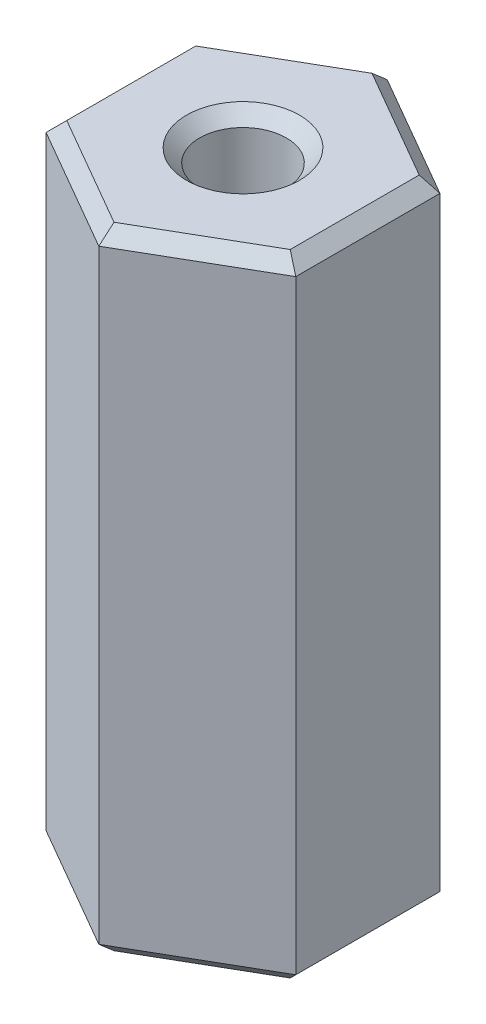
from build123d import *

# Parameters (mm, degrees)
ENL_V_MAT_EXTRU_1_DEPTH      = 52.362547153
ENL_V_MAT_EXTRU_1_DEPTH_BACK = 52.362547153
ESQUISSE2_OUTSIDE_W          = 39.918
ESQUISSE2_OUTSIDE_H          = 39.918
CHANFREIN1_SIZE              = 1


with BuildPart() as part:
    # Esquisse1 → R_volution1 (revolve)
    with BuildSketch(Plane.XY, mode=Mode.PRIVATE) as r_volution1_sk:
        Polygon((-12.925, 0), (-2.925, 0), (-2.925, 20), (0, 22.925), (0, 24.7), (-3.3, 28), (-3.3, 48), (-12.925, 48), align=None)
    revolve(r_volution1_sk.sketch.rotate(Axis((0, 0, 0), (0, 1, 0)), 270), axis=Axis((0, 0, 0), (0, 1, 0)))

    # Esquisse2 outside → Enl_v. mat.-Extru.1 (cut, two sides: drawn at the far end of the back side and taken through both)
    with BuildSketch(Plane(origin=(0, 48, 0), x_dir=(1, 0, 0), z_dir=(0, 1, 0)).offset(-ENL_V_MAT_EXTRU_1_DEPTH_BACK)):
        Rectangle(ESQUISSE2_OUTSIDE_W, ESQUISSE2_OUTSIDE_H)
        Polygon((0, 10.969655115), (-9.5, 5.484827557), (-9.5, -5.484827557), (0, -10.969655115), (9.5, -5.484827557), (9.5, 5.484827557), align=None, mode=Mode.SUBTRACT)
    extrude(amount=ENL_V_MAT_EXTRU_1_DEPTH + ENL_V_MAT_EXTRU_1_DEPTH_BACK, mode=Mode.SUBTRACT)

    # Chanfrein1
    chanfrein1_edges = [part.edges().sort_by_distance(p)[0] for p in [
        (-4.75, 48, -8.227241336),
        (-9.5, 48, 0),
        (-4.75, 48, 8.227241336),
        (4.75, 48, 8.227241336),
        (9.5, 48, 0),
        (4.75, 48, -8.227241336),
        (9.5, 0, 0),
        (4.75, 0, -8.227241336),
        (-4.75, 0, -8.227241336),
        (-9.5, 0, 0),
        (-4.75, 0, 8.227241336),
        (4.75, 0, 8.227241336),
        (0, 48, 3.3),
        (0, 0, 2.925),
    ]]
    chamfer(chanfrein1_edges, length=CHANFREIN1_SIZE)


solid = part.part
